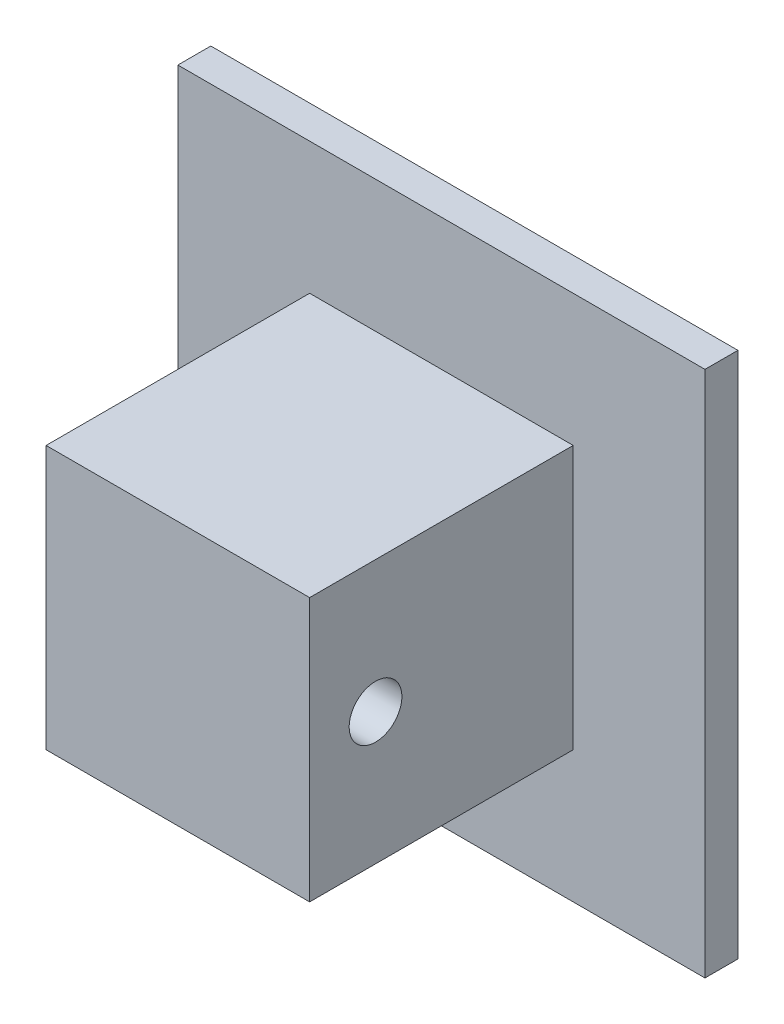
ISO-10303-21;
HEADER;
FILE_DESCRIPTION(('STEP AP214'),'2;1');
FILE_NAME('part.step','',(''),(''),'','','');
FILE_SCHEMA(('AUTOMOTIVE_DESIGN { 1 0 10303 214 1 1 1 1 }'));
ENDSEC;
DATA;
#1=APPLICATION_CONTEXT('core data for automotive mechanical design processes');
#2=APPLICATION_PROTOCOL_DEFINITION('international standard','automotive_design',2000,#1);
#3=PRODUCT_CONTEXT('',#1,'mechanical');
#4=PRODUCT('Part','Part','',(#3));
#5=PRODUCT_RELATED_PRODUCT_CATEGORY('part','',(#4));
#6=PRODUCT_DEFINITION_FORMATION('','',#4);
#7=PRODUCT_DEFINITION_CONTEXT('part definition',#1,'design');
#8=PRODUCT_DEFINITION('design','',#6,#7);
#9=PRODUCT_DEFINITION_SHAPE('','',#8);
#10=(LENGTH_UNIT() NAMED_UNIT(*) SI_UNIT(.MILLI.,.METRE.));
#11=(NAMED_UNIT(*) PLANE_ANGLE_UNIT() SI_UNIT($,.RADIAN.));
#12=(NAMED_UNIT(*) SI_UNIT($,.STERADIAN.) SOLID_ANGLE_UNIT());
#13=UNCERTAINTY_MEASURE_WITH_UNIT(LENGTH_MEASURE(1.E-05),#10,'distance_accuracy_value','');
#14=(GEOMETRIC_REPRESENTATION_CONTEXT(3) GLOBAL_UNCERTAINTY_ASSIGNED_CONTEXT((#13)) GLOBAL_UNIT_ASSIGNED_CONTEXT((#10,
#11,#12)) REPRESENTATION_CONTEXT('',''));
#15=CARTESIAN_POINT('',(0.,0.,0.));
#16=DIRECTION('',(0.,0.,1.));
#17=DIRECTION('',(1.,0.,0.));
#18=AXIS2_PLACEMENT_3D('',#15,#16,#17);
#19=CARTESIAN_POINT('',(0.,80.,5.));
#20=DIRECTION('',(0.,0.,-1.));
#21=DIRECTION('',(-1.,0.,0.));
#22=AXIS2_PLACEMENT_3D('',#19,#20,#21);
#23=PLANE('',#22);
#24=DIRECTION('',(0.,-1.,0.));
#25=VECTOR('',#24,1.);
#26=CARTESIAN_POINT('',(0.,0.,5.));
#27=LINE('',#26,#25);
#28=CARTESIAN_POINT('',(0.,80.,5.));
#29=VERTEX_POINT('',#28);
#30=CARTESIAN_POINT('',(0.,0.,5.));
#31=VERTEX_POINT('',#30);
#32=EDGE_CURVE('E127',#29,#31,#27,.T.);
#33=ORIENTED_EDGE('',*,*,#32,.T.);
#34=DIRECTION('',(1.,0.,0.));
#35=VECTOR('',#34,1.);
#36=CARTESIAN_POINT('',(0.,0.,5.));
#37=LINE('',#36,#35);
#38=CARTESIAN_POINT('',(80.,0.,5.));
#39=VERTEX_POINT('',#38);
#40=EDGE_CURVE('E130',#31,#39,#37,.T.);
#41=ORIENTED_EDGE('',*,*,#40,.T.);
#42=DIRECTION('',(0.,1.,0.));
#43=VECTOR('',#42,1.);
#44=CARTESIAN_POINT('',(80.,0.,5.));
#45=LINE('',#44,#43);
#46=CARTESIAN_POINT('',(80.,80.,5.));
#47=VERTEX_POINT('',#46);
#48=EDGE_CURVE('E132',#39,#47,#45,.T.);
#49=ORIENTED_EDGE('',*,*,#48,.T.);
#50=DIRECTION('',(-1.,0.,0.));
#51=VECTOR('',#50,1.);
#52=CARTESIAN_POINT('',(0.,80.,5.));
#53=LINE('',#52,#51);
#54=EDGE_CURVE('E134',#47,#29,#53,.T.);
#55=ORIENTED_EDGE('',*,*,#54,.T.);
#56=EDGE_LOOP('',(#33,#41,#49,#55));
#57=FACE_BOUND('',#56,.T.);
#58=DIRECTION('',(0.,-1.,0.));
#59=VECTOR('',#58,1.);
#60=CARTESIAN_POINT('',(20.,60.,5.));
#61=LINE('',#60,#59);
#62=CARTESIAN_POINT('',(20.,60.,5.));
#63=VERTEX_POINT('',#62);
#64=CARTESIAN_POINT('',(20.,20.,5.));
#65=VERTEX_POINT('',#64);
#66=EDGE_CURVE('E86',#63,#65,#61,.T.);
#67=ORIENTED_EDGE('',*,*,#66,.F.);
#68=DIRECTION('',(-1.,0.,0.));
#69=VECTOR('',#68,1.);
#70=CARTESIAN_POINT('',(20.,60.,5.));
#71=LINE('',#70,#69);
#72=CARTESIAN_POINT('',(60.,60.,5.));
#73=VERTEX_POINT('',#72);
#74=EDGE_CURVE('E88',#73,#63,#71,.T.);
#75=ORIENTED_EDGE('',*,*,#74,.F.);
#76=DIRECTION('',(0.,1.,0.));
#77=VECTOR('',#76,1.);
#78=CARTESIAN_POINT('',(60.,60.,5.));
#79=LINE('',#78,#77);
#80=CARTESIAN_POINT('',(60.,20.,5.));
#81=VERTEX_POINT('',#80);
#82=EDGE_CURVE('E45',#81,#73,#79,.T.);
#83=ORIENTED_EDGE('',*,*,#82,.F.);
#84=DIRECTION('',(1.,0.,0.));
#85=VECTOR('',#84,1.);
#86=CARTESIAN_POINT('',(20.,20.,5.));
#87=LINE('',#86,#85);
#88=EDGE_CURVE('E40',#65,#81,#87,.T.);
#89=ORIENTED_EDGE('',*,*,#88,.F.);
#90=EDGE_LOOP('',(#67,#75,#83,#89));
#91=FACE_BOUND('',#90,.T.);
#92=ADVANCED_FACE('F24',(#57,#91),#23,.F.);
#93=CARTESIAN_POINT('',(0.,0.,5.));
#94=DIRECTION('',(1.,0.,0.));
#95=DIRECTION('',(0.,0.,-1.));
#96=AXIS2_PLACEMENT_3D('',#93,#94,#95);
#97=PLANE('',#96);
#98=DIRECTION('',(0.,-1.,0.));
#99=VECTOR('',#98,1.);
#100=CARTESIAN_POINT('',(0.,0.,0.));
#101=LINE('',#100,#99);
#102=CARTESIAN_POINT('',(0.,80.,0.));
#103=VERTEX_POINT('',#102);
#104=CARTESIAN_POINT('',(0.,0.,0.));
#105=VERTEX_POINT('',#104);
#106=EDGE_CURVE('E118',#103,#105,#101,.T.);
#107=ORIENTED_EDGE('',*,*,#106,.T.);
#108=DIRECTION('',(0.,0.,-1.));
#109=VECTOR('',#108,1.);
#110=CARTESIAN_POINT('',(0.,0.,5.));
#111=LINE('',#110,#109);
#112=EDGE_CURVE('E11',#31,#105,#111,.T.);
#113=ORIENTED_EDGE('',*,*,#112,.F.);
#114=ORIENTED_EDGE('',*,*,#32,.F.);
#115=DIRECTION('',(0.,0.,-1.));
#116=VECTOR('',#115,1.);
#117=CARTESIAN_POINT('',(0.,80.,5.));
#118=LINE('',#117,#116);
#119=EDGE_CURVE('E136',#29,#103,#118,.T.);
#120=ORIENTED_EDGE('',*,*,#119,.T.);
#121=EDGE_LOOP('',(#107,#113,#114,#120));
#122=FACE_BOUND('',#121,.T.);
#123=ADVANCED_FACE('F26',(#122),#97,.F.);
#124=CARTESIAN_POINT('',(0.,0.,5.));
#125=DIRECTION('',(0.,1.,0.));
#126=DIRECTION('',(0.,0.,1.));
#127=AXIS2_PLACEMENT_3D('',#124,#125,#126);
#128=PLANE('',#127);
#129=DIRECTION('',(1.,0.,0.));
#130=VECTOR('',#129,1.);
#131=CARTESIAN_POINT('',(0.,0.,0.));
#132=LINE('',#131,#130);
#133=CARTESIAN_POINT('',(80.,0.,0.));
#134=VERTEX_POINT('',#133);
#135=EDGE_CURVE('E121',#105,#134,#132,.T.);
#136=ORIENTED_EDGE('',*,*,#135,.T.);
#137=DIRECTION('',(0.,0.,-1.));
#138=VECTOR('',#137,1.);
#139=CARTESIAN_POINT('',(80.,0.,5.));
#140=LINE('',#139,#138);
#141=EDGE_CURVE('E33',#39,#134,#140,.T.);
#142=ORIENTED_EDGE('',*,*,#141,.F.);
#143=ORIENTED_EDGE('',*,*,#40,.F.);
#144=ORIENTED_EDGE('',*,*,#112,.T.);
#145=EDGE_LOOP('',(#136,#142,#143,#144));
#146=FACE_BOUND('',#145,.T.);
#147=ADVANCED_FACE('F162',(#146),#128,.F.);
#148=CARTESIAN_POINT('',(80.,0.,5.));
#149=DIRECTION('',(-1.,0.,0.));
#150=DIRECTION('',(0.,0.,1.));
#151=AXIS2_PLACEMENT_3D('',#148,#149,#150);
#152=PLANE('',#151);
#153=DIRECTION('',(0.,1.,0.));
#154=VECTOR('',#153,1.);
#155=CARTESIAN_POINT('',(80.,0.,0.));
#156=LINE('',#155,#154);
#157=CARTESIAN_POINT('',(80.,80.,0.));
#158=VERTEX_POINT('',#157);
#159=EDGE_CURVE('E123',#134,#158,#156,.T.);
#160=ORIENTED_EDGE('',*,*,#159,.T.);
#161=DIRECTION('',(0.,0.,-1.));
#162=VECTOR('',#161,1.);
#163=CARTESIAN_POINT('',(80.,80.,5.));
#164=LINE('',#163,#162);
#165=EDGE_CURVE('E139',#47,#158,#164,.T.);
#166=ORIENTED_EDGE('',*,*,#165,.F.);
#167=ORIENTED_EDGE('',*,*,#48,.F.);
#168=ORIENTED_EDGE('',*,*,#141,.T.);
#169=EDGE_LOOP('',(#160,#166,#167,#168));
#170=FACE_BOUND('',#169,.T.);
#171=ADVANCED_FACE('F147',(#170),#152,.F.);
#172=CARTESIAN_POINT('',(0.,80.,5.));
#173=DIRECTION('',(0.,-1.,0.));
#174=DIRECTION('',(0.,0.,-1.));
#175=AXIS2_PLACEMENT_3D('',#172,#173,#174);
#176=PLANE('',#175);
#177=DIRECTION('',(-1.,0.,0.));
#178=VECTOR('',#177,1.);
#179=CARTESIAN_POINT('',(0.,80.,0.));
#180=LINE('',#179,#178);
#181=EDGE_CURVE('E125',#158,#103,#180,.T.);
#182=ORIENTED_EDGE('',*,*,#181,.T.);
#183=ORIENTED_EDGE('',*,*,#119,.F.);
#184=ORIENTED_EDGE('',*,*,#54,.F.);
#185=ORIENTED_EDGE('',*,*,#165,.T.);
#186=EDGE_LOOP('',(#182,#183,#184,#185));
#187=FACE_BOUND('',#186,.T.);
#188=ADVANCED_FACE('F156',(#187),#176,.F.);
#189=CARTESIAN_POINT('',(0.,80.,0.));
#190=DIRECTION('',(0.,0.,-1.));
#191=DIRECTION('',(-1.,0.,0.));
#192=AXIS2_PLACEMENT_3D('',#189,#190,#191);
#193=PLANE('',#192);
#194=ORIENTED_EDGE('',*,*,#106,.F.);
#195=ORIENTED_EDGE('',*,*,#181,.F.);
#196=ORIENTED_EDGE('',*,*,#159,.F.);
#197=ORIENTED_EDGE('',*,*,#135,.F.);
#198=EDGE_LOOP('',(#194,#195,#196,#197));
#199=FACE_BOUND('',#198,.T.);
#200=ADVANCED_FACE('F153',(#199),#193,.T.);
#201=CARTESIAN_POINT('',(20.,60.,45.));
#202=DIRECTION('',(1.,0.,0.));
#203=DIRECTION('',(0.,1.,0.));
#204=AXIS2_PLACEMENT_3D('',#201,#202,#203);
#205=PLANE('',#204);
#206=CARTESIAN_POINT('',(20.,40.,35.));
#207=DIRECTION('',(-1.,0.,0.));
#208=DIRECTION('',(0.,-1.,0.));
#209=AXIS2_PLACEMENT_3D('',#206,#207,#208);
#210=CIRCLE('',#209,4.00000000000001);
#211=CARTESIAN_POINT('',(20.,36.,35.));
#212=VERTEX_POINT('',#211);
#213=EDGE_CURVE('E209',#212,#212,#210,.T.);
#214=ORIENTED_EDGE('',*,*,#213,.F.);
#215=EDGE_LOOP('',(#214));
#216=FACE_BOUND('',#215,.T.);
#217=ORIENTED_EDGE('',*,*,#66,.T.);
#218=DIRECTION('',(0.,0.,-1.));
#219=VECTOR('',#218,1.);
#220=CARTESIAN_POINT('',(20.,20.,45.));
#221=LINE('',#220,#219);
#222=CARTESIAN_POINT('',(20.,20.,45.));
#223=VERTEX_POINT('',#222);
#224=EDGE_CURVE('E116',#223,#65,#221,.T.);
#225=ORIENTED_EDGE('',*,*,#224,.F.);
#226=DIRECTION('',(0.,-1.,0.));
#227=VECTOR('',#226,1.);
#228=CARTESIAN_POINT('',(20.,60.,45.));
#229=LINE('',#228,#227);
#230=CARTESIAN_POINT('',(20.,60.,45.));
#231=VERTEX_POINT('',#230);
#232=EDGE_CURVE('E102',#231,#223,#229,.T.);
#233=ORIENTED_EDGE('',*,*,#232,.F.);
#234=DIRECTION('',(0.,0.,-1.));
#235=VECTOR('',#234,1.);
#236=CARTESIAN_POINT('',(20.,60.,45.));
#237=LINE('',#236,#235);
#238=EDGE_CURVE('E98',#231,#63,#237,.T.);
#239=ORIENTED_EDGE('',*,*,#238,.T.);
#240=EDGE_LOOP('',(#217,#225,#233,#239));
#241=FACE_BOUND('',#240,.T.);
#242=ADVANCED_FACE('F104',(#216,#241),#205,.F.);
#243=CARTESIAN_POINT('',(20.,20.,45.));
#244=DIRECTION('',(0.,1.,0.));
#245=DIRECTION('',(0.,0.,1.));
#246=AXIS2_PLACEMENT_3D('',#243,#244,#245);
#247=PLANE('',#246);
#248=ORIENTED_EDGE('',*,*,#88,.T.);
#249=DIRECTION('',(0.,0.,-1.));
#250=VECTOR('',#249,1.);
#251=CARTESIAN_POINT('',(60.,20.,45.));
#252=LINE('',#251,#250);
#253=CARTESIAN_POINT('',(60.,20.,45.));
#254=VERTEX_POINT('',#253);
#255=EDGE_CURVE('E108',#254,#81,#252,.T.);
#256=ORIENTED_EDGE('',*,*,#255,.F.);
#257=DIRECTION('',(1.,0.,0.));
#258=VECTOR('',#257,1.);
#259=CARTESIAN_POINT('',(20.,20.,45.));
#260=LINE('',#259,#258);
#261=EDGE_CURVE('E217',#223,#254,#260,.T.);
#262=ORIENTED_EDGE('',*,*,#261,.F.);
#263=ORIENTED_EDGE('',*,*,#224,.T.);
#264=EDGE_LOOP('',(#248,#256,#262,#263));
#265=FACE_BOUND('',#264,.T.);
#266=ADVANCED_FACE('F184',(#265),#247,.F.);
#267=CARTESIAN_POINT('',(60.,60.,45.));
#268=DIRECTION('',(-1.,0.,0.));
#269=DIRECTION('',(0.,-1.,0.));
#270=AXIS2_PLACEMENT_3D('',#267,#268,#269);
#271=PLANE('',#270);
#272=CARTESIAN_POINT('',(60.,40.,35.));
#273=DIRECTION('',(-1.,0.,0.));
#274=DIRECTION('',(0.,-1.,0.));
#275=AXIS2_PLACEMENT_3D('',#272,#273,#274);
#276=CIRCLE('',#275,4.00000000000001);
#277=CARTESIAN_POINT('',(60.,36.,35.));
#278=VERTEX_POINT('',#277);
#279=EDGE_CURVE('E28',#278,#278,#276,.T.);
#280=ORIENTED_EDGE('',*,*,#279,.T.);
#281=EDGE_LOOP('',(#280));
#282=FACE_BOUND('',#281,.T.);
#283=ORIENTED_EDGE('',*,*,#82,.T.);
#284=DIRECTION('',(0.,0.,-1.));
#285=VECTOR('',#284,1.);
#286=CARTESIAN_POINT('',(60.,60.,45.));
#287=LINE('',#286,#285);
#288=CARTESIAN_POINT('',(60.,60.,45.));
#289=VERTEX_POINT('',#288);
#290=EDGE_CURVE('E101',#289,#73,#287,.T.);
#291=ORIENTED_EDGE('',*,*,#290,.F.);
#292=DIRECTION('',(0.,1.,0.));
#293=VECTOR('',#292,1.);
#294=CARTESIAN_POINT('',(60.,60.,45.));
#295=LINE('',#294,#293);
#296=EDGE_CURVE('E110',#254,#289,#295,.T.);
#297=ORIENTED_EDGE('',*,*,#296,.F.);
#298=ORIENTED_EDGE('',*,*,#255,.T.);
#299=EDGE_LOOP('',(#283,#291,#297,#298));
#300=FACE_BOUND('',#299,.T.);
#301=ADVANCED_FACE('F190',(#282,#300),#271,.F.);
#302=CARTESIAN_POINT('',(20.,60.,45.));
#303=DIRECTION('',(0.,-1.,0.));
#304=DIRECTION('',(0.,0.,-1.));
#305=AXIS2_PLACEMENT_3D('',#302,#303,#304);
#306=PLANE('',#305);
#307=ORIENTED_EDGE('',*,*,#74,.T.);
#308=ORIENTED_EDGE('',*,*,#238,.F.);
#309=DIRECTION('',(-1.,0.,0.));
#310=VECTOR('',#309,1.);
#311=CARTESIAN_POINT('',(20.,60.,45.));
#312=LINE('',#311,#310);
#313=EDGE_CURVE('E106',#289,#231,#312,.T.);
#314=ORIENTED_EDGE('',*,*,#313,.F.);
#315=ORIENTED_EDGE('',*,*,#290,.T.);
#316=EDGE_LOOP('',(#307,#308,#314,#315));
#317=FACE_BOUND('',#316,.T.);
#318=ADVANCED_FACE('F96',(#317),#306,.F.);
#319=CARTESIAN_POINT('',(20.,20.,45.));
#320=DIRECTION('',(0.,0.,1.));
#321=DIRECTION('',(1.,0.,0.));
#322=AXIS2_PLACEMENT_3D('',#319,#320,#321);
#323=PLANE('',#322);
#324=ORIENTED_EDGE('',*,*,#232,.T.);
#325=ORIENTED_EDGE('',*,*,#261,.T.);
#326=ORIENTED_EDGE('',*,*,#296,.T.);
#327=ORIENTED_EDGE('',*,*,#313,.T.);
#328=EDGE_LOOP('',(#324,#325,#326,#327));
#329=FACE_BOUND('',#328,.T.);
#330=ADVANCED_FACE('F199',(#329),#323,.T.);
#331=CARTESIAN_POINT('',(80.,40.,35.));
#332=DIRECTION('',(-1.,0.,0.));
#333=DIRECTION('',(0.,-1.,0.));
#334=AXIS2_PLACEMENT_3D('',#331,#332,#333);
#335=CYLINDRICAL_SURFACE('',#334,4.00000000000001);
#336=CARTESIAN_POINT('',(20.,36.,35.));
#337=CARTESIAN_POINT('',(20.4166666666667,36.,35.));
#338=CARTESIAN_POINT('',(20.8333333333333,36.,35.));
#339=CARTESIAN_POINT('',(21.6666666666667,36.,35.));
#340=CARTESIAN_POINT('',(22.0833333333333,36.,35.));
#341=CARTESIAN_POINT('',(22.9166666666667,36.,35.));
#342=CARTESIAN_POINT('',(23.3333333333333,36.,35.));
#343=CARTESIAN_POINT('',(24.1666666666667,36.,35.));
#344=CARTESIAN_POINT('',(24.5833333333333,36.,35.));
#345=CARTESIAN_POINT('',(25.4166666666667,36.,35.));
#346=CARTESIAN_POINT('',(25.8333333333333,36.,35.));
#347=CARTESIAN_POINT('',(26.6666666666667,36.,35.));
#348=CARTESIAN_POINT('',(27.0833333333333,36.,35.));
#349=CARTESIAN_POINT('',(27.9166666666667,36.,35.));
#350=CARTESIAN_POINT('',(28.3333333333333,36.,35.));
#351=CARTESIAN_POINT('',(29.1666666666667,36.,35.));
#352=CARTESIAN_POINT('',(29.5833333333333,36.,35.));
#353=CARTESIAN_POINT('',(30.4166666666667,36.,35.));
#354=CARTESIAN_POINT('',(30.8333333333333,36.,35.));
#355=CARTESIAN_POINT('',(31.6666666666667,36.,35.));
#356=CARTESIAN_POINT('',(32.0833333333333,36.,35.));
#357=CARTESIAN_POINT('',(32.9166666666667,36.,35.));
#358=CARTESIAN_POINT('',(33.3333333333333,36.,35.));
#359=CARTESIAN_POINT('',(34.1666666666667,36.,35.));
#360=CARTESIAN_POINT('',(34.5833333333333,36.,35.));
#361=CARTESIAN_POINT('',(35.4166666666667,36.,35.));
#362=CARTESIAN_POINT('',(35.8333333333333,36.,35.));
#363=CARTESIAN_POINT('',(36.6666666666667,36.,35.));
#364=CARTESIAN_POINT('',(37.0833333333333,36.,35.));
#365=CARTESIAN_POINT('',(37.9166666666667,36.,35.));
#366=CARTESIAN_POINT('',(38.3333333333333,36.,35.));
#367=CARTESIAN_POINT('',(39.1666666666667,36.,35.));
#368=CARTESIAN_POINT('',(39.5833333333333,36.,35.));
#369=CARTESIAN_POINT('',(40.4166666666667,36.,35.));
#370=CARTESIAN_POINT('',(40.8333333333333,36.,35.));
#371=CARTESIAN_POINT('',(41.6666666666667,36.,35.));
#372=CARTESIAN_POINT('',(42.0833333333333,36.,35.));
#373=CARTESIAN_POINT('',(42.9166666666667,36.,35.));
#374=CARTESIAN_POINT('',(43.3333333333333,36.,35.));
#375=CARTESIAN_POINT('',(44.1666666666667,36.,35.));
#376=CARTESIAN_POINT('',(44.5833333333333,36.,35.));
#377=CARTESIAN_POINT('',(45.4166666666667,36.,35.));
#378=CARTESIAN_POINT('',(45.8333333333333,36.,35.));
#379=CARTESIAN_POINT('',(46.6666666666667,36.,35.));
#380=CARTESIAN_POINT('',(47.0833333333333,36.,35.));
#381=CARTESIAN_POINT('',(47.9166666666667,36.,35.));
#382=CARTESIAN_POINT('',(48.3333333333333,36.,35.));
#383=CARTESIAN_POINT('',(49.1666666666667,36.,35.));
#384=CARTESIAN_POINT('',(49.5833333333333,36.,35.));
#385=CARTESIAN_POINT('',(50.4166666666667,36.,35.));
#386=CARTESIAN_POINT('',(50.8333333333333,36.,35.));
#387=CARTESIAN_POINT('',(51.6666666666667,36.,35.));
#388=CARTESIAN_POINT('',(52.0833333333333,36.,35.));
#389=CARTESIAN_POINT('',(52.9166666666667,36.,35.));
#390=CARTESIAN_POINT('',(53.3333333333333,36.,35.));
#391=CARTESIAN_POINT('',(54.1666666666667,36.,35.));
#392=CARTESIAN_POINT('',(54.5833333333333,36.,35.));
#393=CARTESIAN_POINT('',(55.4166666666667,36.,35.));
#394=CARTESIAN_POINT('',(55.8333333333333,36.,35.));
#395=CARTESIAN_POINT('',(56.6666666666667,36.,35.));
#396=CARTESIAN_POINT('',(57.0833333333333,36.,35.));
#397=CARTESIAN_POINT('',(57.9166666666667,36.,35.));
#398=CARTESIAN_POINT('',(58.3333333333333,36.,35.));
#399=CARTESIAN_POINT('',(59.1666666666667,36.,35.));
#400=CARTESIAN_POINT('',(59.5833333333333,36.,35.));
#401=CARTESIAN_POINT('',(60.,36.,35.));
#402=B_SPLINE_CURVE_WITH_KNOTS('',3,(#336,#337,#338,#339,#340,#341,#342,#343,#344,#345,#346,
#347,#348,#349,#350,#351,#352,#353,#354,#355,#356,#357,#358,#359,#360,#361,#362,#363,#364,#365,
#366,#367,#368,#369,#370,#371,#372,#373,#374,#375,#376,#377,#378,#379,#380,#381,#382,#383,#384,
#385,#386,#387,#388,#389,#390,#391,#392,#393,#394,#395,#396,#397,#398,#399,#400,#401),
.UNSPECIFIED.,.F.,.F.,(4,2,2,2,2,2,2,2,2,2,2,2,2,2,2,2,2,2,2,2,2,2,2,2,2,2,2,2,2,2,2,2,4),(0.,
1.25,2.5,3.75,5.,6.25,7.5,8.75,9.99999999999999,11.25,12.5,13.75,15.,16.25,17.5,18.75,20.,21.25,
22.5,23.75,25.,26.25,27.5,28.75,30.,31.25,32.5,33.75,35.,36.25,37.5,38.75,40.),.UNSPECIFIED.);
#403=EDGE_CURVE('BSEAM201',#212,#278,#402,.T.);
#404=ORIENTED_EDGE('',*,*,#213,.T.);
#405=ORIENTED_EDGE('',*,*,#279,.F.);
#406=ORIENTED_EDGE('',*,*,#403,.T.);
#407=ORIENTED_EDGE('',*,*,#403,.F.);
#408=EDGE_LOOP('',(#404,#406,#405,#407));
#409=FACE_BOUND('',#408,.T.);
#410=ADVANCED_FACE('F201',(#409),#335,.F.);
#411=CLOSED_SHELL('',(#92,#123,#147,#171,#188,#200,#242,#266,#301,#318,#330,#410));
#412=MANIFOLD_SOLID_BREP('B2',#411);
#413=ADVANCED_BREP_SHAPE_REPRESENTATION('',(#18,#412),#14);
#414=SHAPE_DEFINITION_REPRESENTATION(#9,#413);
ENDSEC;
END-ISO-10303-21;
